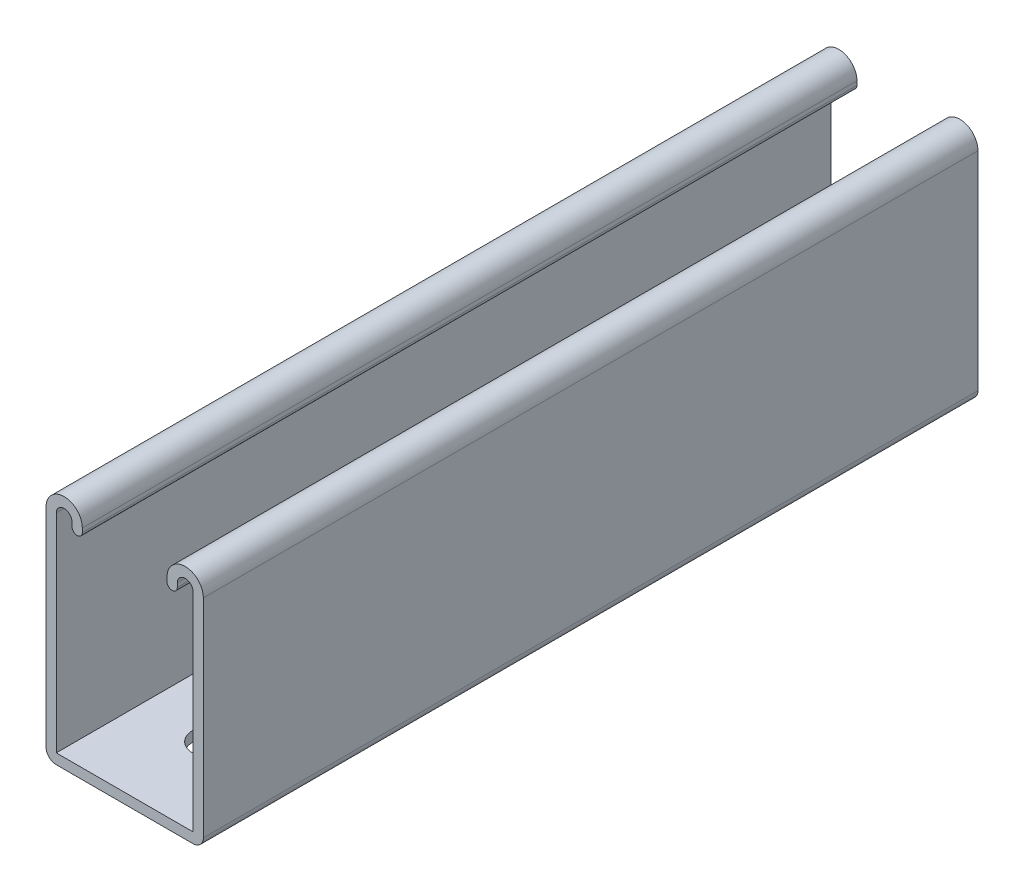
from build123d import *

# Parameters (mm, degrees)
BASE_EXTRUDE_DEPTH = 203.2
SLOT_DEPTH         = 224.346124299
LPATTERN1_COUNT    = 2
LPATTERN1_PITCH    = 101.6


with BuildPart() as part:
    # Sketch1 → Base-Extrude (new body)
    with BuildSketch(Plane.XY):
        with BuildLine():
            Line((-20.6375, 29.1719), (-20.6375, -25.3238))
            ThreePointArc((-20.6375, -25.3238), (-19.848914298, -27.227614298), (-17.9451, -28.0162))
            Line((-17.9451, -28.0162), (17.9451, -28.0162))
            ThreePointArc((17.9451, -28.0162), (19.848914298, -27.227614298), (20.6375, -25.3238))
            Line((20.6375, -25.3238), (20.6375, 29.1719))
            ThreePointArc((20.6375, 29.1719), (15.875, 33.9344), (11.1125, 29.1719))
            Line((11.1125, 29.1719), (11.1125, 28.13685))
            ThreePointArc((11.1125, 28.13685), (12.4587, 26.79065), (13.8049, 28.13685))
            Line((13.8049, 28.13685), (13.8049, 29.1719))
            ThreePointArc((13.8049, 29.1719), (15.875, 31.242), (17.9451, 29.1719))
            Line((17.9451, 29.1719), (17.9451, -25.3238))
            Line((17.9451, -25.3238), (-17.9451, -25.3238))
            Line((-17.9451, -25.3238), (-17.9451, 29.1719))
            ThreePointArc((-17.9451, 29.1719), (-15.875, 31.242), (-13.8049, 29.1719))
            Line((-13.8049, 29.1719), (-13.8049, 28.13685))
            ThreePointArc((-13.8049, 28.13685), (-12.4587, 26.79065), (-11.1125, 28.13685))
            Line((-11.1125, 28.13685), (-11.1125, 29.1719))
            ThreePointArc((-11.1125, 29.1719), (-15.875, 33.9344), (-20.6375, 29.1719))
        make_face()
    extrude(amount=BASE_EXTRUDE_DEPTH)

    # Sketch2 → Slot (cut, through all)
    with BuildSketch(Plane(origin=(-0.186902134, -28.0162, -10.369564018), x_dir=(1, 0, 0), z_dir=(0, -1, 0))):
        with BuildLine():
            Line((5.346277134, 88.950814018), (5.346277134, 23.069564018))
            ThreePointArc((5.346277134, 23.069564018), (0.186902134, 17.910189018), (-4.972472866, 23.069564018))
            Line((-4.972472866, 23.069564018), (-4.972472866, 88.950814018))
            ThreePointArc((-4.972472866, 88.950814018), (0.186902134, 94.110189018), (5.346277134, 88.950814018))
        make_face()
    slot = extrude(amount=-SLOT_DEPTH, mode=Mode.SUBTRACT)

    # LPattern1: Slot ×2
    with Locations(*[(0, 0, i * LPATTERN1_PITCH) for i in range(1, LPATTERN1_COUNT)]):
        add(slot, mode=Mode.SUBTRACT)


solid = part.part
